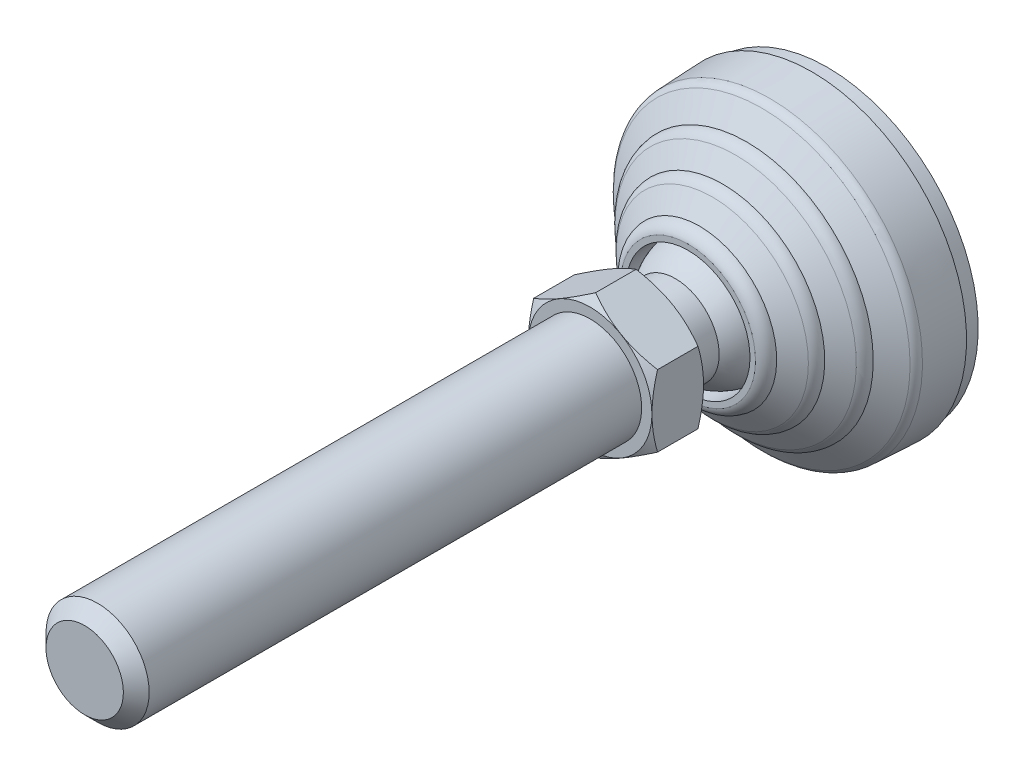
ISO-10303-21;
HEADER;
FILE_DESCRIPTION(('STEP AP214'),'2;1');
FILE_NAME('part.step','',(''),(''),'','','');
FILE_SCHEMA(('AUTOMOTIVE_DESIGN { 1 0 10303 214 1 1 1 1 }'));
ENDSEC;
DATA;
#1=APPLICATION_CONTEXT('core data for automotive mechanical design processes');
#2=APPLICATION_PROTOCOL_DEFINITION('international standard','automotive_design',2000,#1);
#3=PRODUCT_CONTEXT('',#1,'mechanical');
#4=PRODUCT('Part','Part','',(#3));
#5=PRODUCT_RELATED_PRODUCT_CATEGORY('part','',(#4));
#6=PRODUCT_DEFINITION_FORMATION('','',#4);
#7=PRODUCT_DEFINITION_CONTEXT('part definition',#1,'design');
#8=PRODUCT_DEFINITION('design','',#6,#7);
#9=PRODUCT_DEFINITION_SHAPE('','',#8);
#10=(LENGTH_UNIT() NAMED_UNIT(*) SI_UNIT(.MILLI.,.METRE.));
#11=(NAMED_UNIT(*) PLANE_ANGLE_UNIT() SI_UNIT($,.RADIAN.));
#12=(NAMED_UNIT(*) SI_UNIT($,.STERADIAN.) SOLID_ANGLE_UNIT());
#13=UNCERTAINTY_MEASURE_WITH_UNIT(LENGTH_MEASURE(1.E-05),#10,'distance_accuracy_value','');
#14=(GEOMETRIC_REPRESENTATION_CONTEXT(3) GLOBAL_UNCERTAINTY_ASSIGNED_CONTEXT((#13)) GLOBAL_UNIT_ASSIGNED_CONTEXT((#10,
#11,#12)) REPRESENTATION_CONTEXT('',''));
#15=CARTESIAN_POINT('',(0.,0.,0.));
#16=DIRECTION('',(0.,0.,1.));
#17=DIRECTION('',(1.,0.,0.));
#18=AXIS2_PLACEMENT_3D('',#15,#16,#17);
#19=CARTESIAN_POINT('',(0.,0.,93.4665));
#20=DIRECTION('',(0.,0.,-1.));
#21=DIRECTION('',(0.,1.,0.));
#22=AXIS2_PLACEMENT_3D('',#19,#20,#21);
#23=CYLINDRICAL_SURFACE('',#22,10.);
#24=CARTESIAN_POINT('',(0.,0.,141.5));
#25=DIRECTION('',(0.,0.,1.));
#26=DIRECTION('',(0.,-1.,0.));
#27=AXIS2_PLACEMENT_3D('',#24,#25,#26);
#28=CIRCLE('',#27,10.);
#29=CARTESIAN_POINT('',(0.,-10.,141.5));
#30=VERTEX_POINT('',#29);
#31=EDGE_CURVE('E9',#30,#30,#28,.F.);
#32=ORIENTED_EDGE('',*,*,#31,.T.);
#33=EDGE_LOOP('',(#32));
#34=FACE_BOUND('',#33,.T.);
#35=CARTESIAN_POINT('',(0.,0.,46.));
#36=DIRECTION('',(0.,0.,-1.));
#37=DIRECTION('',(0.,1.,0.));
#38=AXIS2_PLACEMENT_3D('',#35,#36,#37);
#39=CIRCLE('',#38,10.);
#40=CARTESIAN_POINT('',(0.,10.,46.));
#41=VERTEX_POINT('',#40);
#42=EDGE_CURVE('E124',#41,#41,#39,.F.);
#43=ORIENTED_EDGE('',*,*,#42,.T.);
#44=EDGE_LOOP('',(#43));
#45=FACE_BOUND('',#44,.T.);
#46=ADVANCED_FACE('F14',(#34,#45),#23,.T.);
#47=CARTESIAN_POINT('',(10.995,0.,46.));
#48=DIRECTION('',(0.,0.,1.));
#49=DIRECTION('',(0.,-1.,0.));
#50=AXIS2_PLACEMENT_3D('',#47,#48,#49);
#51=PLANE('',#50);
#52=CARTESIAN_POINT('',(0.,0.,46.));
#53=DIRECTION('',(0.,0.,-1.));
#54=DIRECTION('',(0.,1.,0.));
#55=AXIS2_PLACEMENT_3D('',#52,#53,#54);
#56=CIRCLE('',#55,11.99);
#57=CARTESIAN_POINT('',(0.,11.99,46.));
#58=VERTEX_POINT('',#57);
#59=EDGE_CURVE('E132',#58,#58,#56,.F.);
#60=ORIENTED_EDGE('',*,*,#59,.T.);
#61=EDGE_LOOP('',(#60));
#62=FACE_BOUND('',#61,.T.);
#63=ORIENTED_EDGE('',*,*,#42,.F.);
#64=EDGE_LOOP('',(#63));
#65=FACE_BOUND('',#64,.T.);
#66=ADVANCED_FACE('F157',(#62,#65),#51,.T.);
#67=CARTESIAN_POINT('',(0.,0.,44.9159643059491));
#68=DIRECTION('',(0.,0.,-1.));
#69=DIRECTION('',(0.,1.,0.));
#70=AXIS2_PLACEMENT_3D('',#67,#68,#69);
#71=CONICAL_SURFACE('',#70,13.8676048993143,1.0471975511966);
#72=ORIENTED_EDGE('',*,*,#59,.F.);
#73=EDGE_LOOP('',(#72));
#74=FACE_BOUND('',#73,.T.);
#75=CARTESIAN_POINT('',(-2.88482840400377E-08,-13.8564064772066,44.9224297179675));
#76=CARTESIAN_POINT('',(0.263784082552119,-13.7041106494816,45.010340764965));
#77=CARTESIAN_POINT('',(0.528551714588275,-13.5512469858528,45.0942615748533));
#78=CARTESIAN_POINT('',(1.06021019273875,-13.2442938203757,45.2530155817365));
#79=CARTESIAN_POINT('',(1.32710170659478,-13.0902039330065,45.3278457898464));
#80=CARTESIAN_POINT('',(2.13207647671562,-12.6254515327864,45.537252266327));
#81=CARTESIAN_POINT('',(2.67333741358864,-12.3129543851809,45.6563603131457));
#82=CARTESIAN_POINT('',(3.48330954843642,-11.8453167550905,45.796023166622));
#83=CARTESIAN_POINT('',(3.74960108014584,-11.6915732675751,45.8358073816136));
#84=CARTESIAN_POINT('',(4.28341699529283,-11.3833745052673,45.9025217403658));
#85=CARTESIAN_POINT('',(4.55094140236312,-11.2289192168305,45.9294516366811));
#86=CARTESIAN_POINT('',(5.08643614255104,-10.9197511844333,45.9697675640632));
#87=CARTESIAN_POINT('',(5.35440556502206,-10.7650389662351,45.9831696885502));
#88=CARTESIAN_POINT('',(5.8905925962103,-10.4554712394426,45.996144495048));
#89=CARTESIAN_POINT('',(6.15881019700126,-10.3006157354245,45.9957176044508));
#90=CARTESIAN_POINT('',(6.66023029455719,-10.0111207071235,45.9820002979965));
#91=CARTESIAN_POINT('',(6.89346857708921,-9.87646052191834,45.97038309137));
#92=CARTESIAN_POINT('',(7.35940867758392,-9.60744987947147,45.9369099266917));
#93=CARTESIAN_POINT('',(7.59211045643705,-9.47309944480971,45.9150532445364));
#94=CARTESIAN_POINT('',(8.05685109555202,-9.20478131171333,45.8614821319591));
#95=CARTESIAN_POINT('',(8.28888924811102,-9.07081402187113,45.8297595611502));
#96=CARTESIAN_POINT('',(8.75187776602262,-8.80350747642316,45.7570131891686));
#97=CARTESIAN_POINT('',(8.98282805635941,-8.67016826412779,45.7159887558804));
#98=CARTESIAN_POINT('',(9.68388987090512,-8.26541003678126,45.5779256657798));
#99=CARTESIAN_POINT('',(10.1519713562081,-7.99516306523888,45.4671213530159));
#100=CARTESIAN_POINT('',(11.081155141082,-7.45869855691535,45.2156417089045));
#101=CARTESIAN_POINT('',(11.5422693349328,-7.19247415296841,45.075025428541));
#102=CARTESIAN_POINT('',(11.9999999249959,-6.92820327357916,44.922429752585));
#103=B_SPLINE_CURVE_WITH_KNOTS('',3,(#75,#76,#77,#78,#79,#80,#81,#82,#83,#84,#85,#86,#87,#88,
#89,#90,#91,#92,#93,#94,#95,#96,#97,#98,#99,#100,#101,#102),.UNSPECIFIED.,.F.,.F.,(4,2,2,2,2,2,
2,2,2,2,2,2,2,4),(0.,0.950996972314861,1.90230578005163,3.80897261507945,4.73890631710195,
5.6688579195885,6.59770188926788,7.52651715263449,8.33503482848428,9.14360968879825,
9.95285348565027,10.7621522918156,12.4163368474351,14.0672749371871),.UNSPECIFIED.);
#104=CARTESIAN_POINT('',(-1.44241383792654E-08,-13.8564064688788,44.9224297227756));
#105=VERTEX_POINT('',#104);
#106=CARTESIAN_POINT('',(12.,-6.92820324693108,44.9224297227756));
#107=VERTEX_POINT('',#106);
#108=EDGE_CURVE('E143',#105,#107,#103,.T.);
#109=ORIENTED_EDGE('',*,*,#108,.T.);
#110=CARTESIAN_POINT('',(12.,-6.92820326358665,44.9224297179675));
#111=CARTESIAN_POINT('',(12.,-6.64374493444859,45.0045333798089));
#112=CARTESIAN_POINT('',(12.,-6.35829458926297,45.0831531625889));
#113=CARTESIAN_POINT('',(12.,-5.78524260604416,45.2325348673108));
#114=CARTESIAN_POINT('',(12.,-5.49764024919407,45.3032940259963));
#115=CARTESIAN_POINT('',(12.,-4.63053083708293,45.5026195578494));
#116=CARTESIAN_POINT('',(12.,-4.04782834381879,45.6179071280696));
#117=CARTESIAN_POINT('',(12.,-3.17548925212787,45.7575170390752));
#118=CARTESIAN_POINT('',(12.,-2.88840964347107,45.7982045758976));
#119=CARTESIAN_POINT('',(12.,-2.31290718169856,45.8685767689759));
#120=CARTESIAN_POINT('',(12.,-2.02448443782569,45.8982623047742));
#121=CARTESIAN_POINT('',(12.,-1.44696804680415,45.9459902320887));
#122=CARTESIAN_POINT('',(12.,-1.15787537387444,45.9640443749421));
#123=CARTESIAN_POINT('',(12.,-0.579188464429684,45.9881624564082));
#124=CARTESIAN_POINT('',(12.,-0.289594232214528,45.994226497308));
#125=CARTESIAN_POINT('',(12.,0.289594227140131,45.9942264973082));
#126=CARTESIAN_POINT('',(12.,0.579188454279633,45.9881624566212));
#127=CARTESIAN_POINT('',(12.,1.15787535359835,45.9640443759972));
#128=CARTESIAN_POINT('',(12.,1.44696802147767,45.9459902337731));
#129=CARTESIAN_POINT('',(12.,2.02448440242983,45.8982623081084));
#130=CARTESIAN_POINT('',(12.,2.31290714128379,45.8685767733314));
#131=CARTESIAN_POINT('',(12.,2.88840959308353,45.798204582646));
#132=CARTESIAN_POINT('',(12.,3.17548919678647,45.7575170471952));
#133=CARTESIAN_POINT('',(12.,4.04782827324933,45.6179071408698));
#134=CARTESIAN_POINT('',(12.,4.63053075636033,45.5026195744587));
#135=CARTESIAN_POINT('',(12.,5.49764015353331,45.3032940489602));
#136=CARTESIAN_POINT('',(12.,5.78524250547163,45.2325348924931));
#137=CARTESIAN_POINT('',(12.,6.35829447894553,45.0831531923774));
#138=CARTESIAN_POINT('',(12.,6.64374481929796,45.004533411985));
#139=CARTESIAN_POINT('',(12.,6.92820314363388,44.9224297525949));
#140=B_SPLINE_CURVE_WITH_KNOTS('',3,(#110,#111,#112,#113,#114,#115,#116,#117,#118,#119,#120,
#121,#122,#123,#124,#125,#126,#127,#128,#129,#130,#131,#132,#133,#134,#135,#136,#137,#138,#139),
.UNSPECIFIED.,.F.,.F.,(4,2,2,2,2,2,2,2,2,2,2,2,2,2,4),(0.,0.888148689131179,1.77660860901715,
3.55698615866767,4.42666281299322,5.2962699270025,6.16499708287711,7.03371682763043,
7.90243655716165,8.7711636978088,9.64077079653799,10.5104474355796,12.2908249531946,
13.1792848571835,14.0674335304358),.UNSPECIFIED.);
#141=CARTESIAN_POINT('',(12.0000000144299,6.92820322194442,44.9224297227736));
#142=VERTEX_POINT('',#141);
#143=EDGE_CURVE('E135',#107,#142,#140,.T.);
#144=ORIENTED_EDGE('',*,*,#143,.T.);
#145=CARTESIAN_POINT('',(12.0000000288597,6.92820321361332,44.9224297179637));
#146=CARTESIAN_POINT('',(11.7362159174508,7.08049904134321,45.0103407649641));
#147=CARTESIAN_POINT('',(11.4714482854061,7.23336270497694,45.0942615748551));
#148=CARTESIAN_POINT('',(10.9397898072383,7.54031587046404,45.2530155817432));
#149=CARTESIAN_POINT('',(10.6728982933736,7.69440575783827,45.3278457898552));
#150=CARTESIAN_POINT('',(9.86792352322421,8.15915815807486,45.5372522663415));
#151=CARTESIAN_POINT('',(9.32666258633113,8.47165530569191,45.6563603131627));
#152=CARTESIAN_POINT('',(8.51669045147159,8.93929293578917,45.7960231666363));
#153=CARTESIAN_POINT('',(8.25039891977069,9.0930364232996,45.8358073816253));
#154=CARTESIAN_POINT('',(7.71658300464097,9.40123518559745,45.9025217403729));
#155=CARTESIAN_POINT('',(7.44905859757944,9.55569047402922,45.9294516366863));
#156=CARTESIAN_POINT('',(6.91356385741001,9.86485850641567,45.9697675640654));
#157=CARTESIAN_POINT('',(6.64559443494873,10.0195707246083,45.9831696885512));
#158=CARTESIAN_POINT('',(6.10940740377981,10.3291384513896,45.996144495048));
#159=CARTESIAN_POINT('',(5.84118980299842,10.4839939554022,45.9957176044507));
#160=CARTESIAN_POINT('',(5.33976970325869,10.773488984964,45.9820002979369));
#161=CARTESIAN_POINT('',(5.10653141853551,10.9081491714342,45.970383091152));
#162=CARTESIAN_POINT('',(4.64059131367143,11.1771598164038,45.9369099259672));
#163=CARTESIAN_POINT('',(4.4078895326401,11.3115102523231,45.9150532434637));
#164=CARTESIAN_POINT('',(3.94314888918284,11.5798283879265,45.8614821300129));
#165=CARTESIAN_POINT('',(3.71111073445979,11.7137956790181,45.8297595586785));
#166=CARTESIAN_POINT('',(3.24812221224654,11.9811022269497,45.7570131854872));
#167=CARTESIAN_POINT('',(3.01717191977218,12.1144414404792,45.7159887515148));
#168=CARTESIAN_POINT('',(2.31611009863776,12.5191996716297,45.5779256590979));
#169=CARTESIAN_POINT('',(1.84802860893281,12.7894466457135,45.4671213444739));
#170=CARTESIAN_POINT('',(0.918844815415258,13.3259111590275,45.2156416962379));
#171=CARTESIAN_POINT('',(0.457730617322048,13.5921355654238,45.0750254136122));
#172=CARTESIAN_POINT('',(2.30778996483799E-08,13.856406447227,44.9224297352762));
#173=B_SPLINE_CURVE_WITH_KNOTS('',3,(#145,#146,#147,#148,#149,#150,#151,#152,#153,#154,#155,
#156,#157,#158,#159,#160,#161,#162,#163,#164,#165,#166,#167,#168,#169,#170,#171,#172),
.UNSPECIFIED.,.F.,.F.,(4,2,2,2,2,2,2,2,2,2,2,2,2,4),(0.,0.95099697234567,1.9023057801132,
3.8089726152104,4.73890631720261,5.66885791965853,6.59770188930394,7.52651715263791,
8.33503483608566,9.14360970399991,9.95285350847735,10.7621523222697,12.4163368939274,
14.0672749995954),.UNSPECIFIED.);
#174=CARTESIAN_POINT('',(-1.15389591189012E-08,13.856406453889,44.92242973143));
#175=VERTEX_POINT('',#174);
#176=EDGE_CURVE('E181',#142,#175,#173,.T.);
#177=ORIENTED_EDGE('',*,*,#176,.T.);
#178=CARTESIAN_POINT('',(-2.30779115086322E-08,13.856406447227,44.9224297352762));
#179=CARTESIAN_POINT('',(-0.263784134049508,13.7041106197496,45.0103407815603));
#180=CARTESIAN_POINT('',(-0.528551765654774,13.5512469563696,45.0942615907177));
#181=CARTESIAN_POINT('',(-1.06021024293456,13.2442937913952,45.2530155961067));
#182=CARTESIAN_POINT('',(-1.32710175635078,13.0902039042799,45.3278458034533));
#183=CARTESIAN_POINT('',(-2.13207652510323,12.6254515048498,45.5372522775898));
#184=CARTESIAN_POINT('',(-2.67333746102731,12.3129543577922,45.656360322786));
#185=CARTESIAN_POINT('',(-3.48330959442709,11.8453167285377,45.7960231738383));
#186=CARTESIAN_POINT('',(-3.74960112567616,11.6915732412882,45.8358073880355));
#187=CARTESIAN_POINT('',(-4.28341703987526,11.3833744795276,45.9025217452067));
#188=CARTESIAN_POINT('',(-4.55094144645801,11.2289191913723,45.9294516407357));
#189=CARTESIAN_POINT('',(-5.08643618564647,10.9197511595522,45.9697675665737));
#190=CARTESIAN_POINT('',(-5.35440560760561,10.7650389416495,45.9831696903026));
#191=CARTESIAN_POINT('',(-5.89059263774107,10.4554712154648,45.9961444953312));
#192=CARTESIAN_POINT('',(-6.15881023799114,10.300615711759,45.9957176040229));
#193=CARTESIAN_POINT('',(-6.66023033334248,10.0111206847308,45.9820002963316));
#194=CARTESIAN_POINT('',(-6.89346861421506,9.87646050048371,45.9703830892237));
#195=CARTESIAN_POINT('',(-7.35940871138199,9.60744985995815,45.9369099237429));
#196=CARTESIAN_POINT('',(-7.59211048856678,9.47309942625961,45.9150532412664));
#197=CARTESIAN_POINT('',(-8.05685112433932,9.20478129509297,45.8614821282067));
#198=CARTESIAN_POINT('',(-8.28888927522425,9.0708140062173,45.8297595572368));
#199=CARTESIAN_POINT('',(-8.75187778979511,8.80350746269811,45.7570131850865));
#200=CARTESIAN_POINT('',(-8.98282807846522,8.67016825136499,45.7159887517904));
#201=CARTESIAN_POINT('',(-9.68388988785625,8.26541002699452,45.5779256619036));
#202=CARTESIAN_POINT('',(-10.1519713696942,7.9951630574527,45.4671213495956));
#203=CARTESIAN_POINT('',(-11.0811551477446,7.45869855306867,45.2156417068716));
#204=CARTESIAN_POINT('',(-11.5422693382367,7.19247415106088,45.0750254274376));
#205=CARTESIAN_POINT('',(-11.9999999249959,6.92820327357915,44.922429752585));
#206=B_SPLINE_CURVE_WITH_KNOTS('',3,(#178,#179,#180,#181,#182,#183,#184,#185,#186,#187,#188,
#189,#190,#191,#192,#193,#194,#195,#196,#197,#198,#199,#200,#201,#202,#203,#204,#205),
.UNSPECIFIED.,.F.,.F.,(4,2,2,2,2,2,2,2,2,2,2,2,2,4),(0.,0.9509969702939,1.90230577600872,
3.80897260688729,4.73890630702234,5.6688579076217,6.5977018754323,7.52651713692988,
8.33503480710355,9.14360966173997,9.95285345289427,10.7621522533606,12.4163367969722,
14.0672748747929),.UNSPECIFIED.);
#207=CARTESIAN_POINT('',(-12.,6.92820324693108,44.9224297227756));
#208=VERTEX_POINT('',#207);
#209=EDGE_CURVE('E173',#175,#208,#206,.T.);
#210=ORIENTED_EDGE('',*,*,#209,.T.);
#211=CARTESIAN_POINT('',(-12.,6.92820326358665,44.9224297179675));
#212=CARTESIAN_POINT('',(-12.,6.64374493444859,45.0045333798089));
#213=CARTESIAN_POINT('',(-12.,6.35829458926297,45.0831531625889));
#214=CARTESIAN_POINT('',(-12.,5.78524260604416,45.2325348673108));
#215=CARTESIAN_POINT('',(-12.,5.49764024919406,45.3032940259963));
#216=CARTESIAN_POINT('',(-12.,4.63053083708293,45.5026195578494));
#217=CARTESIAN_POINT('',(-12.,4.04782834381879,45.6179071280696));
#218=CARTESIAN_POINT('',(-12.,3.17548925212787,45.7575170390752));
#219=CARTESIAN_POINT('',(-12.,2.88840964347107,45.7982045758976));
#220=CARTESIAN_POINT('',(-12.,2.31290718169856,45.8685767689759));
#221=CARTESIAN_POINT('',(-12.,2.02448443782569,45.8982623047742));
#222=CARTESIAN_POINT('',(-12.,1.44696804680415,45.9459902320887));
#223=CARTESIAN_POINT('',(-12.,1.15787537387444,45.9640443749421));
#224=CARTESIAN_POINT('',(-12.,0.579188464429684,45.9881624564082));
#225=CARTESIAN_POINT('',(-12.,0.289594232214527,45.994226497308));
#226=CARTESIAN_POINT('',(-12.,-0.289594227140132,45.9942264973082));
#227=CARTESIAN_POINT('',(-12.,-0.579188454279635,45.9881624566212));
#228=CARTESIAN_POINT('',(-12.,-1.15787535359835,45.9640443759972));
#229=CARTESIAN_POINT('',(-12.,-1.44696802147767,45.9459902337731));
#230=CARTESIAN_POINT('',(-12.,-2.02448440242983,45.8982623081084));
#231=CARTESIAN_POINT('',(-12.,-2.31290714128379,45.8685767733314));
#232=CARTESIAN_POINT('',(-12.,-2.88840959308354,45.798204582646));
#233=CARTESIAN_POINT('',(-12.,-3.17548919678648,45.7575170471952));
#234=CARTESIAN_POINT('',(-12.,-4.04782827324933,45.6179071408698));
#235=CARTESIAN_POINT('',(-12.,-4.63053075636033,45.5026195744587));
#236=CARTESIAN_POINT('',(-12.,-5.49764015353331,45.3032940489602));
#237=CARTESIAN_POINT('',(-12.,-5.78524250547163,45.2325348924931));
#238=CARTESIAN_POINT('',(-12.,-6.35829447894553,45.0831531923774));
#239=CARTESIAN_POINT('',(-12.,-6.64374481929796,45.004533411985));
#240=CARTESIAN_POINT('',(-12.,-6.92820314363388,44.9224297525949));
#241=B_SPLINE_CURVE_WITH_KNOTS('',3,(#211,#212,#213,#214,#215,#216,#217,#218,#219,#220,#221,
#222,#223,#224,#225,#226,#227,#228,#229,#230,#231,#232,#233,#234,#235,#236,#237,#238,#239,#240),
.UNSPECIFIED.,.F.,.F.,(4,2,2,2,2,2,2,2,2,2,2,2,2,2,4),(0.,0.888148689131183,1.77660860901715,
3.55698615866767,4.42666281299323,5.2962699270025,6.16499708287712,7.03371682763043,
7.90243655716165,8.7711636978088,9.640770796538,10.5104474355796,12.2908249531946,
13.1792848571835,14.0674335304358),.UNSPECIFIED.);
#242=CARTESIAN_POINT('',(-12.0000000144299,-6.92820322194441,44.9224297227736));
#243=VERTEX_POINT('',#242);
#244=EDGE_CURVE('E350',#208,#243,#241,.T.);
#245=ORIENTED_EDGE('',*,*,#244,.T.);
#246=CARTESIAN_POINT('',(-12.0000000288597,-6.92820321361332,44.9224297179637));
#247=CARTESIAN_POINT('',(-11.7362159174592,-7.08049904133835,45.0103407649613));
#248=CARTESIAN_POINT('',(-11.471448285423,-7.23336270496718,45.0942615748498));
#249=CARTESIAN_POINT('',(-10.9397898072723,-7.54031587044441,45.2530155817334));
#250=CARTESIAN_POINT('',(-10.6728982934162,-7.69440575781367,45.3278457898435));
#251=CARTESIAN_POINT('',(-9.86792352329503,-8.15915815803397,45.5372522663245));
#252=CARTESIAN_POINT('',(-9.3266625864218,-8.47165530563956,45.6563603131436));
#253=CARTESIAN_POINT('',(-8.5166904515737,-8.93929293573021,45.7960231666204));
#254=CARTESIAN_POINT('',(-8.25039891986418,-9.09303642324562,45.8358073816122));
#255=CARTESIAN_POINT('',(-7.71658300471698,-9.40123518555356,45.9025217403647));
#256=CARTESIAN_POINT('',(-7.44905859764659,-9.55569047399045,45.9294516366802));
#257=CARTESIAN_POINT('',(-6.91356385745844,-9.8648585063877,45.9697675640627));
#258=CARTESIAN_POINT('',(-6.64559443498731,-10.019570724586,45.9831696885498));
#259=CARTESIAN_POINT('',(-6.10940740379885,-10.3291384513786,45.996144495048));
#260=CARTESIAN_POINT('',(-5.84118980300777,-10.4839939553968,45.9957176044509));
#261=CARTESIAN_POINT('',(-5.33976970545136,-10.7734889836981,45.9820002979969));
#262=CARTESIAN_POINT('',(-5.10653142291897,-10.9081491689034,45.9703830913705));
#263=CARTESIAN_POINT('',(-4.64059132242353,-11.1771598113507,45.9369099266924));
#264=CARTESIAN_POINT('',(-4.40788954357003,-11.3115102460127,45.9150532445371));
#265=CARTESIAN_POINT('',(-3.94314890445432,-11.5798283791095,45.8614821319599));
#266=CARTESIAN_POINT('',(-3.71111075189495,-11.7137956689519,45.8297595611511));
#267=CARTESIAN_POINT('',(-3.24812223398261,-11.9811022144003,45.7570131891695));
#268=CARTESIAN_POINT('',(-3.01717194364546,-12.1144414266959,45.7159887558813));
#269=CARTESIAN_POINT('',(-2.3161101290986,-12.5191996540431,45.5779256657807));
#270=CARTESIAN_POINT('',(-1.84802864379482,-12.7894466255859,45.4671213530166));
#271=CARTESIAN_POINT('',(-0.918844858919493,-13.3259111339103,45.215641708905));
#272=CARTESIAN_POINT('',(-0.457730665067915,-13.5921355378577,45.0750254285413));
#273=CARTESIAN_POINT('',(-7.50040961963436E-08,-13.8564064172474,44.922429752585));
#274=B_SPLINE_CURVE_WITH_KNOTS('',3,(#246,#247,#248,#249,#250,#251,#252,#253,#254,#255,#256,
#257,#258,#259,#260,#261,#262,#263,#264,#265,#266,#267,#268,#269,#270,#271,#272,#273),
.UNSPECIFIED.,.F.,.F.,(4,2,2,2,2,2,2,2,2,2,2,2,2,4),(0.,0.950996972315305,1.90230578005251,
3.80897261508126,4.73890631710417,5.66885791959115,6.59770188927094,7.52651715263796,
8.33503482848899,9.14360968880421,9.95285348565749,10.7621522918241,12.4163368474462,
14.0672749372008),.UNSPECIFIED.);
#275=EDGE_CURVE('E163',#243,#105,#274,.T.);
#276=ORIENTED_EDGE('',*,*,#275,.T.);
#277=EDGE_LOOP('',(#109,#144,#177,#210,#245,#276));
#278=FACE_BOUND('',#277,.T.);
#279=ADVANCED_FACE('F152',(#74,#278),#71,.T.);
#280=CARTESIAN_POINT('',(0.,-13.856406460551,46.1));
#281=DIRECTION('',(0.5,0.866025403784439,0.));
#282=DIRECTION('',(-0.866025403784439,0.5,0.));
#283=AXIS2_PLACEMENT_3D('',#280,#281,#282);
#284=PLANE('',#283);
#285=DIRECTION('',(0.,0.,1.));
#286=VECTOR('',#285,1.);
#287=CARTESIAN_POINT('',(0.,-13.856406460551,46.1));
#288=LINE('',#287,#286);
#289=CARTESIAN_POINT('',(0.,-13.856406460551,37.0775702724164));
#290=VERTEX_POINT('',#289);
#291=EDGE_CURVE('E376',#290,#105,#288,.T.);
#292=ORIENTED_EDGE('',*,*,#291,.T.);
#293=ORIENTED_EDGE('',*,*,#275,.F.);
#294=DIRECTION('',(0.,0.,1.));
#295=VECTOR('',#294,1.);
#296=CARTESIAN_POINT('',(-12.,-6.9282032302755,46.1));
#297=LINE('',#296,#295);
#298=CARTESIAN_POINT('',(-12.,-6.9282032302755,37.0775702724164));
#299=VERTEX_POINT('',#298);
#300=EDGE_CURVE('E368',#299,#243,#297,.T.);
#301=ORIENTED_EDGE('',*,*,#300,.F.);
#302=CARTESIAN_POINT('',(0.,-13.856406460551,37.0775702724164));
#303=CARTESIAN_POINT('',(-0.263784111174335,-13.7041106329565,36.9896592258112));
#304=CARTESIAN_POINT('',(-0.528551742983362,-13.5512469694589,36.9057384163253));
#305=CARTESIAN_POINT('',(-1.0602102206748,-13.2442938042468,36.7469844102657));
#306=CARTESIAN_POINT('',(-1.32710173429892,-13.0902039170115,36.6721542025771));
#307=CARTESIAN_POINT('',(-2.13207650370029,-12.6254515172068,36.4627477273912));
#308=CARTESIAN_POINT('',(-2.67333744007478,-12.3129543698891,36.3436396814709));
#309=CARTESIAN_POINT('',(-3.48330957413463,-11.8453167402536,36.2039768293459));
#310=CARTESIAN_POINT('',(-3.74960110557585,-11.6915732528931,36.1641926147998));
#311=CARTESIAN_POINT('',(-4.28341702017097,-11.3833744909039,36.097478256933));
#312=CARTESIAN_POINT('',(-4.55094142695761,-11.2289192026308,36.0705483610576));
#313=CARTESIAN_POINT('',(-5.08643616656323,-10.9197511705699,36.0302324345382));
#314=CARTESIAN_POINT('',(-5.35440558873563,-10.765038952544,36.0168303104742));
#315=CARTESIAN_POINT('',(-5.89059261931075,-10.4554712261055,36.0038555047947));
#316=CARTESIAN_POINT('',(-6.15881021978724,-10.300615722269,36.0042823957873));
#317=CARTESIAN_POINT('',(-6.66023031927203,-10.0111206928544,36.0179997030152));
#318=CARTESIAN_POINT('',(-6.8934686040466,-9.87646050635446,36.029616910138));
#319=CARTESIAN_POINT('',(-7.35940870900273,-9.6074498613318,36.063090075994));
#320=CARTESIAN_POINT('',(-7.59211049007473,-9.47309942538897,36.0849467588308));
#321=CARTESIAN_POINT('',(-8.05685113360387,-9.20478128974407,36.1385178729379));
#322=CARTESIAN_POINT('',(-8.28888928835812,-9.07081399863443,36.1702404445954));
#323=CARTESIAN_POINT('',(-8.75187781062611,-8.8035074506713,36.2429868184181));
#324=CARTESIAN_POINT('',(-8.98282810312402,-8.67016823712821,36.2840112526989));
#325=CARTESIAN_POINT('',(-9.6838899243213,-8.2654100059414,36.4220743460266));
#326=CARTESIAN_POINT('',(-10.1519714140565,-7.99516303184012,36.5328786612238));
#327=CARTESIAN_POINT('',(-11.0811552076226,-7.45869851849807,36.7843583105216));
#328=CARTESIAN_POINT('',(-11.5422694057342,-7.19247411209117,36.924974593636));
#329=CARTESIAN_POINT('',(-12.,-6.9282032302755,37.0775702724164));
#330=B_SPLINE_CURVE_WITH_KNOTS('',3,(#302,#303,#304,#305,#306,#307,#308,#309,#310,#311,#312,
#313,#314,#315,#316,#317,#318,#319,#320,#321,#322,#323,#324,#325,#326,#327,#328,#329),
.UNSPECIFIED.,.F.,.F.,(4,2,2,2,2,2,2,2,2,2,2,2,2,4),(0.,0.950996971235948,1.90230577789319,
3.80897261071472,4.73890631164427,5.66885791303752,6.59770188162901,7.52651714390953,
8.33503482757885,9.14360969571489,9.9528535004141,10.7621523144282,12.4163368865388,
14.0672749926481),.UNSPECIFIED.);
#331=EDGE_CURVE('E370',#290,#299,#330,.T.);
#332=ORIENTED_EDGE('',*,*,#331,.F.);
#333=EDGE_LOOP('',(#292,#293,#301,#332));
#334=FACE_BOUND('',#333,.T.);
#335=ADVANCED_FACE('F156',(#334),#284,.F.);
#336=CARTESIAN_POINT('',(12.,-6.92820323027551,46.1));
#337=DIRECTION('',(-0.5,0.866025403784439,0.));
#338=DIRECTION('',(-0.866025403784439,-0.5,0.));
#339=AXIS2_PLACEMENT_3D('',#336,#337,#338);
#340=PLANE('',#339);
#341=DIRECTION('',(0.,0.,1.));
#342=VECTOR('',#341,1.);
#343=CARTESIAN_POINT('',(12.,-6.92820323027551,46.1));
#344=LINE('',#343,#342);
#345=CARTESIAN_POINT('',(12.,-6.92820323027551,37.0775702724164));
#346=VERTEX_POINT('',#345);
#347=EDGE_CURVE('E31',#346,#107,#344,.T.);
#348=ORIENTED_EDGE('',*,*,#347,.T.);
#349=ORIENTED_EDGE('',*,*,#108,.F.);
#350=ORIENTED_EDGE('',*,*,#291,.F.);
#351=CARTESIAN_POINT('',(12.,-6.92820323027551,37.0775702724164));
#352=CARTESIAN_POINT('',(11.7362158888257,-7.08049905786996,36.9896592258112));
#353=CARTESIAN_POINT('',(11.4714482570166,-7.2333627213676,36.9057384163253));
#354=CARTESIAN_POINT('',(10.9397897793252,-7.5403158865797,36.7469844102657));
#355=CARTESIAN_POINT('',(10.6728982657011,-7.69440577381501,36.6721542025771));
#356=CARTESIAN_POINT('',(9.86792349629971,-8.15915817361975,36.4627477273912));
#357=CARTESIAN_POINT('',(9.32666255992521,-8.4716553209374,36.3436396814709));
#358=CARTESIAN_POINT('',(8.51669042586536,-8.93929295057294,36.2039768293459));
#359=CARTESIAN_POINT('',(8.25039889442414,-9.09303643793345,36.1641926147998));
#360=CARTESIAN_POINT('',(7.71658297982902,-9.40123519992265,36.097478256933));
#361=CARTESIAN_POINT('',(7.44905857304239,-9.55569048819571,36.0705483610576));
#362=CARTESIAN_POINT('',(6.91356383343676,-9.86485852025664,36.0302324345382));
#363=CARTESIAN_POINT('',(6.64559441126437,-10.0195707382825,36.0168303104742));
#364=CARTESIAN_POINT('',(6.10940738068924,-10.329138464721,36.0038555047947));
#365=CARTESIAN_POINT('',(5.84118978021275,-10.4839939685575,36.0042823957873));
#366=CARTESIAN_POINT('',(5.33976968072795,-10.7734889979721,36.0179997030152));
#367=CARTESIAN_POINT('',(5.10653139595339,-10.9081491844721,36.029616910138));
#368=CARTESIAN_POINT('',(4.64059129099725,-11.1771598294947,36.063090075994));
#369=CARTESIAN_POINT('',(4.40788950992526,-11.3115102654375,36.0849467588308));
#370=CARTESIAN_POINT('',(3.94314886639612,-11.5798284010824,36.1385178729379));
#371=CARTESIAN_POINT('',(3.71111071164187,-11.7137956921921,36.1702404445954));
#372=CARTESIAN_POINT('',(3.24812218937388,-11.9811022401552,36.2429868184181));
#373=CARTESIAN_POINT('',(3.01717189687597,-12.1144414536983,36.2840112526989));
#374=CARTESIAN_POINT('',(2.3161100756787,-12.5191996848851,36.4220743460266));
#375=CARTESIAN_POINT('',(1.84802858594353,-12.7894466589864,36.5328786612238));
#376=CARTESIAN_POINT('',(0.918844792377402,-13.3259111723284,36.7843583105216));
#377=CARTESIAN_POINT('',(0.457730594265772,-13.5921355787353,36.924974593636));
#378=CARTESIAN_POINT('',(0.,-13.856406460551,37.0775702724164));
#379=B_SPLINE_CURVE_WITH_KNOTS('',3,(#351,#352,#353,#354,#355,#356,#357,#358,#359,#360,#361,
#362,#363,#364,#365,#366,#367,#368,#369,#370,#371,#372,#373,#374,#375,#376,#377,#378),
.UNSPECIFIED.,.F.,.F.,(4,2,2,2,2,2,2,2,2,2,2,2,2,4),(0.,0.95099697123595,1.90230577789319,
3.80897261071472,4.73890631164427,5.66885791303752,6.59770188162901,7.52651714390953,
8.33503482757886,9.14360969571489,9.9528535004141,10.7621523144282,12.4163368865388,
14.0672749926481),.UNSPECIFIED.);
#380=EDGE_CURVE('E377',#346,#290,#379,.T.);
#381=ORIENTED_EDGE('',*,*,#380,.F.);
#382=EDGE_LOOP('',(#348,#349,#350,#381));
#383=FACE_BOUND('',#382,.T.);
#384=ADVANCED_FACE('F383',(#383),#340,.F.);
#385=CARTESIAN_POINT('',(-12.,6.92820323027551,46.1));
#386=DIRECTION('',(0.5,-0.866025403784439,0.));
#387=DIRECTION('',(0.866025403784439,0.5,0.));
#388=AXIS2_PLACEMENT_3D('',#385,#386,#387);
#389=PLANE('',#388);
#390=DIRECTION('',(0.,0.,1.));
#391=VECTOR('',#390,1.);
#392=CARTESIAN_POINT('',(-12.,6.92820323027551,46.1));
#393=LINE('',#392,#391);
#394=CARTESIAN_POINT('',(-12.,6.92820323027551,37.0775702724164));
#395=VERTEX_POINT('',#394);
#396=EDGE_CURVE('E369',#395,#208,#393,.T.);
#397=ORIENTED_EDGE('',*,*,#396,.T.);
#398=ORIENTED_EDGE('',*,*,#209,.F.);
#399=DIRECTION('',(0.,0.,1.));
#400=VECTOR('',#399,1.);
#401=CARTESIAN_POINT('',(0.,13.856406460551,46.1));
#402=LINE('',#401,#400);
#403=CARTESIAN_POINT('',(0.,13.856406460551,37.0775702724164));
#404=VERTEX_POINT('',#403);
#405=EDGE_CURVE('E212',#404,#175,#402,.T.);
#406=ORIENTED_EDGE('',*,*,#405,.F.);
#407=CARTESIAN_POINT('',(-12.,6.92820323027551,37.0775702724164));
#408=CARTESIAN_POINT('',(-11.7362158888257,7.08049905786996,36.9896592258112));
#409=CARTESIAN_POINT('',(-11.4714482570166,7.2333627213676,36.9057384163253));
#410=CARTESIAN_POINT('',(-10.9397897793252,7.5403158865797,36.7469844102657));
#411=CARTESIAN_POINT('',(-10.6728982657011,7.69440577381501,36.6721542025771));
#412=CARTESIAN_POINT('',(-9.86792349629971,8.15915817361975,36.4627477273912));
#413=CARTESIAN_POINT('',(-9.32666255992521,8.4716553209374,36.3436396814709));
#414=CARTESIAN_POINT('',(-8.51669042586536,8.93929295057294,36.2039768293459));
#415=CARTESIAN_POINT('',(-8.25039889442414,9.09303643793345,36.1641926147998));
#416=CARTESIAN_POINT('',(-7.71658297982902,9.40123519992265,36.097478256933));
#417=CARTESIAN_POINT('',(-7.44905857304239,9.55569048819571,36.0705483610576));
#418=CARTESIAN_POINT('',(-6.91356383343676,9.86485852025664,36.0302324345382));
#419=CARTESIAN_POINT('',(-6.64559441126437,10.0195707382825,36.0168303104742));
#420=CARTESIAN_POINT('',(-6.10940738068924,10.329138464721,36.0038555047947));
#421=CARTESIAN_POINT('',(-5.84118978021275,10.4839939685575,36.0042823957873));
#422=CARTESIAN_POINT('',(-5.33976968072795,10.7734889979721,36.0179997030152));
#423=CARTESIAN_POINT('',(-5.10653139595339,10.9081491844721,36.029616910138));
#424=CARTESIAN_POINT('',(-4.64059129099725,11.1771598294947,36.063090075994));
#425=CARTESIAN_POINT('',(-4.40788950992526,11.3115102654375,36.0849467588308));
#426=CARTESIAN_POINT('',(-3.94314886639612,11.5798284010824,36.1385178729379));
#427=CARTESIAN_POINT('',(-3.71111071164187,11.7137956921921,36.1702404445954));
#428=CARTESIAN_POINT('',(-3.24812218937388,11.9811022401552,36.2429868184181));
#429=CARTESIAN_POINT('',(-3.01717189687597,12.1144414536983,36.2840112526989));
#430=CARTESIAN_POINT('',(-2.3161100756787,12.5191996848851,36.4220743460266));
#431=CARTESIAN_POINT('',(-1.84802858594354,12.7894466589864,36.5328786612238));
#432=CARTESIAN_POINT('',(-0.918844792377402,13.3259111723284,36.7843583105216));
#433=CARTESIAN_POINT('',(-0.457730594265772,13.5921355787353,36.924974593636));
#434=CARTESIAN_POINT('',(0.,13.856406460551,37.0775702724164));
#435=B_SPLINE_CURVE_WITH_KNOTS('',3,(#407,#408,#409,#410,#411,#412,#413,#414,#415,#416,#417,
#418,#419,#420,#421,#422,#423,#424,#425,#426,#427,#428,#429,#430,#431,#432,#433,#434),
.UNSPECIFIED.,.F.,.F.,(4,2,2,2,2,2,2,2,2,2,2,2,2,4),(0.,0.95099697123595,1.90230577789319,
3.80897261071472,4.73890631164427,5.66885791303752,6.59770188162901,7.52651714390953,
8.33503482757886,9.14360969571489,9.9528535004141,10.7621523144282,12.4163368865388,
14.0672749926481),.UNSPECIFIED.);
#436=EDGE_CURVE('E214',#395,#404,#435,.T.);
#437=ORIENTED_EDGE('',*,*,#436,.F.);
#438=EDGE_LOOP('',(#397,#398,#406,#437));
#439=FACE_BOUND('',#438,.T.);
#440=ADVANCED_FACE('F200',(#439),#389,.F.);
#441=CARTESIAN_POINT('',(-12.,-6.92820323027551,46.1));
#442=DIRECTION('',(1.,0.,0.));
#443=DIRECTION('',(0.,1.,0.));
#444=AXIS2_PLACEMENT_3D('',#441,#442,#443);
#445=PLANE('',#444);
#446=ORIENTED_EDGE('',*,*,#300,.T.);
#447=ORIENTED_EDGE('',*,*,#244,.F.);
#448=ORIENTED_EDGE('',*,*,#396,.F.);
#449=CARTESIAN_POINT('',(-12.,-6.9282032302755,37.0775702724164));
#450=CARTESIAN_POINT('',(-12.,-6.64374490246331,36.9954666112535));
#451=CARTESIAN_POINT('',(-12.,-6.35829455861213,36.9168468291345));
#452=CARTESIAN_POINT('',(-12.,-5.78524257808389,36.7674651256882));
#453=CARTESIAN_POINT('',(-12.,-5.49764022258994,36.6967059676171));
#454=CARTESIAN_POINT('',(-12.,-4.63053081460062,36.4973804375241));
#455=CARTESIAN_POINT('',(-12.,-4.04782832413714,36.3820928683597));
#456=CARTESIAN_POINT('',(-12.,-3.17548923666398,36.2424829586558));
#457=CARTESIAN_POINT('',(-12.,-2.88840962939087,36.2017954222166));
#458=CARTESIAN_POINT('',(-12.,-2.31290717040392,36.1314232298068));
#459=CARTESIAN_POINT('',(-12.,-2.02448442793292,36.1017376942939));
#460=CARTESIAN_POINT('',(-12.,-1.44696803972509,36.0540097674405));
#461=CARTESIAN_POINT('',(-12.,-1.1578753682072,36.035955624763));
#462=CARTESIAN_POINT('',(-12.,-0.579188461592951,36.0118375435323));
#463=CARTESIAN_POINT('',(-12.,-0.289594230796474,36.0057735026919));
#464=CARTESIAN_POINT('',(-12.,0.28959423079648,36.0057735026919));
#465=CARTESIAN_POINT('',(-12.,0.579188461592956,36.0118375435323));
#466=CARTESIAN_POINT('',(-12.,1.15787536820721,36.035955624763));
#467=CARTESIAN_POINT('',(-12.,1.4469680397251,36.0540097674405));
#468=CARTESIAN_POINT('',(-12.,2.02448442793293,36.1017376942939));
#469=CARTESIAN_POINT('',(-12.,2.31290717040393,36.1314232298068));
#470=CARTESIAN_POINT('',(-12.,2.88840962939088,36.2017954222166));
#471=CARTESIAN_POINT('',(-12.,3.17548923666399,36.2424829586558));
#472=CARTESIAN_POINT('',(-12.,4.04782832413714,36.3820928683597));
#473=CARTESIAN_POINT('',(-12.,4.63053081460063,36.4973804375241));
#474=CARTESIAN_POINT('',(-12.,5.49764022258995,36.6967059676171));
#475=CARTESIAN_POINT('',(-12.,5.7852425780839,36.7674651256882));
#476=CARTESIAN_POINT('',(-12.,6.35829455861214,36.9168468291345));
#477=CARTESIAN_POINT('',(-12.,6.64374490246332,36.9954666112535));
#478=CARTESIAN_POINT('',(-12.,6.92820323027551,37.0775702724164));
#479=B_SPLINE_CURVE_WITH_KNOTS('',3,(#449,#450,#451,#452,#453,#454,#455,#456,#457,#458,#459,
#460,#461,#462,#463,#464,#465,#466,#467,#468,#469,#470,#471,#472,#473,#474,#475,#476,#477,#478),
.UNSPECIFIED.,.F.,.F.,(4,2,2,2,2,2,2,2,2,2,2,2,2,2,4),(0.,0.888148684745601,1.77660860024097,
3.55698614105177,4.42666279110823,5.29626990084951,6.16499705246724,7.03371679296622,
7.90243653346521,8.77116368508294,9.64077079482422,10.5104474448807,12.2908249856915,
13.1792849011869,14.0674335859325),.UNSPECIFIED.);
#480=EDGE_CURVE('E362',#299,#395,#479,.T.);
#481=ORIENTED_EDGE('',*,*,#480,.F.);
#482=EDGE_LOOP('',(#446,#447,#448,#481));
#483=FACE_BOUND('',#482,.T.);
#484=ADVANCED_FACE('F356',(#483),#445,.F.);
#485=CARTESIAN_POINT('',(12.,6.92820323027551,46.1));
#486=DIRECTION('',(-1.,0.,0.));
#487=DIRECTION('',(0.,-1.,0.));
#488=AXIS2_PLACEMENT_3D('',#485,#486,#487);
#489=PLANE('',#488);
#490=DIRECTION('',(0.,0.,1.));
#491=VECTOR('',#490,1.);
#492=CARTESIAN_POINT('',(12.,6.92820323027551,46.1));
#493=LINE('',#492,#491);
#494=CARTESIAN_POINT('',(12.,6.9282032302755,37.0775702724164));
#495=VERTEX_POINT('',#494);
#496=EDGE_CURVE('E410',#142,#495,#493,.F.);
#497=ORIENTED_EDGE('',*,*,#496,.F.);
#498=ORIENTED_EDGE('',*,*,#143,.F.);
#499=ORIENTED_EDGE('',*,*,#347,.F.);
#500=CARTESIAN_POINT('',(12.,6.92820323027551,37.0775702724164));
#501=CARTESIAN_POINT('',(12.,6.64374490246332,36.9954666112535));
#502=CARTESIAN_POINT('',(12.,6.35829455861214,36.9168468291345));
#503=CARTESIAN_POINT('',(12.,5.7852425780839,36.7674651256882));
#504=CARTESIAN_POINT('',(12.,5.49764022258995,36.6967059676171));
#505=CARTESIAN_POINT('',(12.,4.63053081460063,36.4973804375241));
#506=CARTESIAN_POINT('',(12.,4.04782832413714,36.3820928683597));
#507=CARTESIAN_POINT('',(12.,3.17548923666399,36.2424829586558));
#508=CARTESIAN_POINT('',(12.,2.88840962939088,36.2017954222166));
#509=CARTESIAN_POINT('',(12.,2.31290717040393,36.1314232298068));
#510=CARTESIAN_POINT('',(12.,2.02448442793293,36.1017376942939));
#511=CARTESIAN_POINT('',(12.,1.4469680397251,36.0540097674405));
#512=CARTESIAN_POINT('',(12.,1.1578753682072,36.035955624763));
#513=CARTESIAN_POINT('',(12.,0.579188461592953,36.0118375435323));
#514=CARTESIAN_POINT('',(12.,0.289594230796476,36.0057735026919));
#515=CARTESIAN_POINT('',(12.,-0.289594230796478,36.0057735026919));
#516=CARTESIAN_POINT('',(12.,-0.579188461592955,36.0118375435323));
#517=CARTESIAN_POINT('',(12.,-1.15787536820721,36.035955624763));
#518=CARTESIAN_POINT('',(12.,-1.4469680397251,36.0540097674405));
#519=CARTESIAN_POINT('',(12.,-2.02448442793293,36.1017376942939));
#520=CARTESIAN_POINT('',(12.,-2.31290717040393,36.1314232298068));
#521=CARTESIAN_POINT('',(12.,-2.88840962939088,36.2017954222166));
#522=CARTESIAN_POINT('',(12.,-3.17548923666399,36.2424829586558));
#523=CARTESIAN_POINT('',(12.,-4.04782832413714,36.3820928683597));
#524=CARTESIAN_POINT('',(12.,-4.63053081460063,36.4973804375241));
#525=CARTESIAN_POINT('',(12.,-5.49764022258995,36.6967059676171));
#526=CARTESIAN_POINT('',(12.,-5.7852425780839,36.7674651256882));
#527=CARTESIAN_POINT('',(12.,-6.35829455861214,36.9168468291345));
#528=CARTESIAN_POINT('',(12.,-6.64374490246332,36.9954666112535));
#529=CARTESIAN_POINT('',(12.,-6.92820323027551,37.0775702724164));
#530=B_SPLINE_CURVE_WITH_KNOTS('',3,(#500,#501,#502,#503,#504,#505,#506,#507,#508,#509,#510,
#511,#512,#513,#514,#515,#516,#517,#518,#519,#520,#521,#522,#523,#524,#525,#526,#527,#528,#529),
.UNSPECIFIED.,.F.,.F.,(4,2,2,2,2,2,2,2,2,2,2,2,2,2,4),(0.,0.888148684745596,1.77660860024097,
3.55698614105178,4.42666279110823,5.29626990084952,6.16499705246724,7.03371679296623,
7.90243653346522,8.77116368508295,9.64077079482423,10.5104474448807,12.2908249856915,
13.1792849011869,14.0674335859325),.UNSPECIFIED.);
#531=EDGE_CURVE('E189',#495,#346,#530,.T.);
#532=ORIENTED_EDGE('',*,*,#531,.F.);
#533=EDGE_LOOP('',(#497,#498,#499,#532));
#534=FACE_BOUND('',#533,.T.);
#535=ADVANCED_FACE('F150',(#534),#489,.F.);
#536=CARTESIAN_POINT('',(0.,13.856406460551,46.1));
#537=DIRECTION('',(-0.5,-0.866025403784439,0.));
#538=DIRECTION('',(0.866025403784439,-0.5,0.));
#539=AXIS2_PLACEMENT_3D('',#536,#537,#538);
#540=PLANE('',#539);
#541=ORIENTED_EDGE('',*,*,#405,.T.);
#542=ORIENTED_EDGE('',*,*,#176,.F.);
#543=ORIENTED_EDGE('',*,*,#496,.T.);
#544=CARTESIAN_POINT('',(0.,13.856406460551,37.0775702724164));
#545=CARTESIAN_POINT('',(0.263784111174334,13.7041106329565,36.9896592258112));
#546=CARTESIAN_POINT('',(0.528551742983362,13.5512469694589,36.9057384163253));
#547=CARTESIAN_POINT('',(1.0602102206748,13.2442938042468,36.7469844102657));
#548=CARTESIAN_POINT('',(1.32710173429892,13.0902039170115,36.6721542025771));
#549=CARTESIAN_POINT('',(2.13207650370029,12.6254515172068,36.4627477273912));
#550=CARTESIAN_POINT('',(2.67333744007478,12.3129543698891,36.3436396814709));
#551=CARTESIAN_POINT('',(3.48330957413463,11.8453167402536,36.2039768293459));
#552=CARTESIAN_POINT('',(3.74960110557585,11.6915732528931,36.1641926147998));
#553=CARTESIAN_POINT('',(4.28341702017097,11.3833744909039,36.097478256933));
#554=CARTESIAN_POINT('',(4.55094142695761,11.2289192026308,36.0705483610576));
#555=CARTESIAN_POINT('',(5.08643616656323,10.9197511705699,36.0302324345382));
#556=CARTESIAN_POINT('',(5.35440558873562,10.765038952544,36.0168303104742));
#557=CARTESIAN_POINT('',(5.89059261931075,10.4554712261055,36.0038555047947));
#558=CARTESIAN_POINT('',(6.15881021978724,10.300615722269,36.0042823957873));
#559=CARTESIAN_POINT('',(6.66023031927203,10.0111206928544,36.0179997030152));
#560=CARTESIAN_POINT('',(6.8934686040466,9.87646050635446,36.029616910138));
#561=CARTESIAN_POINT('',(7.35940870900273,9.6074498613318,36.063090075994));
#562=CARTESIAN_POINT('',(7.59211049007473,9.47309942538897,36.0849467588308));
#563=CARTESIAN_POINT('',(8.05685113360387,9.20478128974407,36.1385178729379));
#564=CARTESIAN_POINT('',(8.28888928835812,9.07081399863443,36.1702404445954));
#565=CARTESIAN_POINT('',(8.75187781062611,8.8035074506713,36.2429868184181));
#566=CARTESIAN_POINT('',(8.98282810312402,8.67016823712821,36.2840112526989));
#567=CARTESIAN_POINT('',(9.6838899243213,8.2654100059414,36.4220743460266));
#568=CARTESIAN_POINT('',(10.1519714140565,7.99516303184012,36.5328786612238));
#569=CARTESIAN_POINT('',(11.0811552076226,7.45869851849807,36.7843583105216));
#570=CARTESIAN_POINT('',(11.5422694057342,7.19247411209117,36.924974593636));
#571=CARTESIAN_POINT('',(12.,6.9282032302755,37.0775702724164));
#572=B_SPLINE_CURVE_WITH_KNOTS('',3,(#544,#545,#546,#547,#548,#549,#550,#551,#552,#553,#554,
#555,#556,#557,#558,#559,#560,#561,#562,#563,#564,#565,#566,#567,#568,#569,#570,#571),
.UNSPECIFIED.,.F.,.F.,(4,2,2,2,2,2,2,2,2,2,2,2,2,4),(0.,0.950996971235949,1.90230577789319,
3.80897261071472,4.73890631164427,5.66885791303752,6.59770188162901,7.52651714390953,
8.33503482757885,9.14360969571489,9.9528535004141,10.7621523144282,12.4163368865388,
14.0672749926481),.UNSPECIFIED.);
#573=EDGE_CURVE('E68',#404,#495,#572,.T.);
#574=ORIENTED_EDGE('',*,*,#573,.F.);
#575=EDGE_LOOP('',(#541,#542,#543,#574));
#576=FACE_BOUND('',#575,.T.);
#577=ADVANCED_FACE('F196',(#576),#540,.F.);
#578=CARTESIAN_POINT('',(0.,0.,37.0840356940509));
#579=DIRECTION('',(0.,0.,1.));
#580=DIRECTION('',(0.,-1.,0.));
#581=AXIS2_PLACEMENT_3D('',#578,#579,#580);
#582=CONICAL_SURFACE('',#581,13.8676048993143,1.0471975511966);
#583=CARTESIAN_POINT('',(0.,0.,36.));
#584=DIRECTION('',(0.,0.,1.));
#585=DIRECTION('',(0.,-1.,0.));
#586=AXIS2_PLACEMENT_3D('',#583,#584,#585);
#587=CIRCLE('',#586,11.99);
#588=CARTESIAN_POINT('',(0.,-11.99,36.));
#589=VERTEX_POINT('',#588);
#590=EDGE_CURVE('E213',#589,#589,#587,.T.);
#591=ORIENTED_EDGE('',*,*,#590,.T.);
#592=EDGE_LOOP('',(#591));
#593=FACE_BOUND('',#592,.T.);
#594=ORIENTED_EDGE('',*,*,#573,.T.);
#595=ORIENTED_EDGE('',*,*,#531,.T.);
#596=ORIENTED_EDGE('',*,*,#380,.T.);
#597=ORIENTED_EDGE('',*,*,#331,.T.);
#598=ORIENTED_EDGE('',*,*,#480,.T.);
#599=ORIENTED_EDGE('',*,*,#436,.T.);
#600=EDGE_LOOP('',(#594,#595,#596,#597,#598,#599));
#601=FACE_BOUND('',#600,.T.);
#602=ADVANCED_FACE('F199',(#593,#601),#582,.T.);
#603=CARTESIAN_POINT('',(10.245,0.,36.));
#604=DIRECTION('',(0.,0.,-1.));
#605=DIRECTION('',(0.,1.,0.));
#606=AXIS2_PLACEMENT_3D('',#603,#604,#605);
#607=PLANE('',#606);
#608=CARTESIAN_POINT('',(0.,0.,36.));
#609=DIRECTION('',(0.,0.,-1.));
#610=DIRECTION('',(0.,1.,0.));
#611=AXIS2_PLACEMENT_3D('',#608,#609,#610);
#612=CIRCLE('',#611,8.5);
#613=CARTESIAN_POINT('',(0.,8.5,36.));
#614=VERTEX_POINT('',#613);
#615=EDGE_CURVE('E222',#614,#614,#612,.F.);
#616=ORIENTED_EDGE('',*,*,#615,.T.);
#617=EDGE_LOOP('',(#616));
#618=FACE_BOUND('',#617,.T.);
#619=ORIENTED_EDGE('',*,*,#590,.F.);
#620=EDGE_LOOP('',(#619));
#621=FACE_BOUND('',#620,.T.);
#622=ADVANCED_FACE('F437',(#618,#621),#607,.T.);
#623=CARTESIAN_POINT('',(0.,0.,32.7352685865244));
#624=DIRECTION('',(0.,0.,-1.));
#625=DIRECTION('',(0.,1.,0.));
#626=AXIS2_PLACEMENT_3D('',#623,#624,#625);
#627=CYLINDRICAL_SURFACE('',#626,8.5);
#628=ORIENTED_EDGE('',*,*,#615,.F.);
#629=EDGE_LOOP('',(#628));
#630=FACE_BOUND('',#629,.T.);
#631=CARTESIAN_POINT('',(0.,0.,29.4705371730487));
#632=DIRECTION('',(0.,0.,-1.));
#633=DIRECTION('',(0.,1.,0.));
#634=AXIS2_PLACEMENT_3D('',#631,#632,#633);
#635=CIRCLE('',#634,8.5);
#636=CARTESIAN_POINT('',(0.,8.5,29.4705371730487));
#637=VERTEX_POINT('',#636);
#638=EDGE_CURVE('E97',#637,#637,#635,.F.);
#639=ORIENTED_EDGE('',*,*,#638,.T.);
#640=EDGE_LOOP('',(#639));
#641=FACE_BOUND('',#640,.T.);
#642=ADVANCED_FACE('F117',(#630,#641),#627,.T.);
#643=CARTESIAN_POINT('',(0.,0.,21.));
#644=DIRECTION('',(1.,0.,0.));
#645=DIRECTION('',(0.,0.,1.));
#646=AXIS2_PLACEMENT_3D('',#643,#644,#645);
#647=SPHERICAL_SURFACE('',#646,12.);
#648=CARTESIAN_POINT('',(0.,0.,21.));
#649=DIRECTION('',(0.,0.,1.));
#650=DIRECTION('',(1.,0.,0.));
#651=AXIS2_PLACEMENT_3D('',#648,#649,#650);
#652=CIRCLE('',#651,12.);
#653=CARTESIAN_POINT('',(0.,12.,21.));
#654=VERTEX_POINT('',#653);
#655=CARTESIAN_POINT('',(-12.,0.,21.));
#656=VERTEX_POINT('',#655);
#657=EDGE_CURVE('E77',#654,#656,#652,.T.);
#658=ORIENTED_EDGE('',*,*,#657,.T.);
#659=CARTESIAN_POINT('',(-12.,0.,21.));
#660=CARTESIAN_POINT('',(-12.0000041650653,-0.196349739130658,21.));
#661=CARTESIAN_POINT('',(-11.9951810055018,-0.392699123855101,21.));
#662=CARTESIAN_POINT('',(-11.9759099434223,-0.784925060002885,21.));
#663=CARTESIAN_POINT('',(-11.9614620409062,-0.980801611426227,21.));
#664=CARTESIAN_POINT('',(-11.9229713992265,-1.37160975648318,21.));
#665=CARTESIAN_POINT('',(-11.8989286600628,-1.5665413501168,21.));
#666=CARTESIAN_POINT('',(-11.841307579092,-1.95499003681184,21.));
#667=CARTESIAN_POINT('',(-11.8077292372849,-2.14850712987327,21.));
#668=CARTESIAN_POINT('',(-11.7311174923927,-2.53366059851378,21.));
#669=CARTESIAN_POINT('',(-11.6880840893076,-2.72529697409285,21.));
#670=CARTESIAN_POINT('',(-11.5926659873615,-3.10622734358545,21.));
#671=CARTESIAN_POINT('',(-11.5402812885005,-3.29552133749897,21.));
#672=CARTESIAN_POINT('',(-11.4262867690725,-3.67131091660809,21.));
#673=CARTESIAN_POINT('',(-11.3646769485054,-3.85780650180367,21.));
#674=CARTESIAN_POINT('',(-11.2323806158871,-4.22754997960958,21.));
#675=CARTESIAN_POINT('',(-11.1616941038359,-4.41079787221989,21.));
#676=CARTESIAN_POINT('',(-11.011414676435,-4.77360450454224,21.));
#677=CARTESIAN_POINT('',(-10.9318217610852,-4.95316324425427,21.));
#678=CARTESIAN_POINT('',(-10.7639212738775,-5.30815899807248,21.));
#679=CARTESIAN_POINT('',(-10.6756137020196,-5.48359601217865,21.));
#680=CARTESIAN_POINT('',(-10.4904966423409,-5.82992567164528,21.));
#681=CARTESIAN_POINT('',(-10.3936871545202,-6.00081831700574,21.));
#682=CARTESIAN_POINT('',(-10.1917994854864,-6.33764754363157,21.));
#683=CARTESIAN_POINT('',(-10.0867213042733,-6.50358412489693,20.9999999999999));
#684=CARTESIAN_POINT('',(-9.8685493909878,-6.83010146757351,20.9999999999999));
#685=CARTESIAN_POINT('',(-9.75545565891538,-6.99068222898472,20.9999999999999));
#686=CARTESIAN_POINT('',(-9.5215250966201,-7.30610107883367,20.9999999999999));
#687=CARTESIAN_POINT('',(-9.40068826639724,-7.4609391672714,20.9999999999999));
#688=CARTESIAN_POINT('',(-9.15156261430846,-7.76449965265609,20.9999999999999));
#689=CARTESIAN_POINT('',(-9.02327379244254,-7.91322204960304,20.9999999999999));
#690=CARTESIAN_POINT('',(-8.75955321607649,-8.20419286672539,20.9999999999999));
#691=CARTESIAN_POINT('',(-8.62412146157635,-8.3464412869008,20.9999999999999));
#692=CARTESIAN_POINT('',(-8.3464412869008,-8.62412146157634,20.9999999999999));
#693=CARTESIAN_POINT('',(-8.2041928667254,-8.75955321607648,20.9999999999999));
#694=CARTESIAN_POINT('',(-7.91322204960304,-9.02327379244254,20.9999999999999));
#695=CARTESIAN_POINT('',(-7.76449965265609,-9.15156261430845,20.9999999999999));
#696=CARTESIAN_POINT('',(-7.4609391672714,-9.40068826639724,20.9999999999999));
#697=CARTESIAN_POINT('',(-7.30610107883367,-9.5215250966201,20.9999999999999));
#698=CARTESIAN_POINT('',(-6.99068222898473,-9.75545565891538,20.9999999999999));
#699=CARTESIAN_POINT('',(-6.83010146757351,-9.8685493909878,20.9999999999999));
#700=CARTESIAN_POINT('',(-6.50358412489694,-10.0867213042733,20.9999999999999));
#701=CARTESIAN_POINT('',(-6.33764754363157,-10.1917994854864,20.9999999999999));
#702=CARTESIAN_POINT('',(-6.00081831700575,-10.3936871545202,20.9999999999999));
#703=CARTESIAN_POINT('',(-5.82992567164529,-10.4904966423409,20.9999999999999));
#704=CARTESIAN_POINT('',(-5.48359601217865,-10.6756137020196,20.9999999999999));
#705=CARTESIAN_POINT('',(-5.30815899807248,-10.7639212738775,20.9999999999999));
#706=CARTESIAN_POINT('',(-4.95316324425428,-10.9318217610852,20.9999999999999));
#707=CARTESIAN_POINT('',(-4.77360450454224,-11.011414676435,20.9999999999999));
#708=CARTESIAN_POINT('',(-4.4107978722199,-11.1616941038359,20.9999999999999));
#709=CARTESIAN_POINT('',(-4.22754997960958,-11.2323806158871,20.9999999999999));
#710=CARTESIAN_POINT('',(-3.85780650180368,-11.3646769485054,20.9999999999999));
#711=CARTESIAN_POINT('',(-3.6713109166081,-11.4262867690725,20.9999999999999));
#712=CARTESIAN_POINT('',(-3.29552133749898,-11.5402812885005,20.9999999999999));
#713=CARTESIAN_POINT('',(-3.10622734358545,-11.5926659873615,20.9999999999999));
#714=CARTESIAN_POINT('',(-2.72529697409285,-11.6880840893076,20.9999999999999));
#715=CARTESIAN_POINT('',(-2.53366059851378,-11.7311174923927,20.9999999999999));
#716=CARTESIAN_POINT('',(-2.14850712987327,-11.8077292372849,20.9999999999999));
#717=CARTESIAN_POINT('',(-1.95499003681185,-11.841307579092,20.9999999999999));
#718=CARTESIAN_POINT('',(-1.5665413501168,-11.8989286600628,20.9999999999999));
#719=CARTESIAN_POINT('',(-1.37160975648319,-11.9229713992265,20.9999999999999));
#720=CARTESIAN_POINT('',(-0.980801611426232,-11.9614620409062,20.9999999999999));
#721=CARTESIAN_POINT('',(-0.78492506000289,-11.9759099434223,20.9999999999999));
#722=CARTESIAN_POINT('',(-0.392699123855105,-11.9951810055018,20.9999999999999));
#723=CARTESIAN_POINT('',(-0.196349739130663,-12.0000041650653,20.9999999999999));
#724=CARTESIAN_POINT('',(0.,-12.,20.9999999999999));
#725=B_SPLINE_CURVE_WITH_KNOTS('',3,(#659,#660,#661,#662,#663,#664,#665,#666,#667,#668,#669,
#670,#671,#672,#673,#674,#675,#676,#677,#678,#679,#680,#681,#682,#683,#684,#685,#686,#687,#688,
#689,#690,#691,#692,#693,#694,#695,#696,#697,#698,#699,#700,#701,#702,#703,#704,#705,#706,#707,
#708,#709,#710,#711,#712,#713,#714,#715,#716,#717,#718,#719,#720,#721,#722,#723,#724),
.UNSPECIFIED.,.F.,.F.,(4,2,2,2,2,2,2,2,2,2,2,2,2,2,2,2,2,2,2,2,2,2,2,2,2,2,2,2,2,2,2,2,4),(0.,
0.588989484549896,1.17797896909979,1.76696845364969,2.35595793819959,2.94494742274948,
3.53393690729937,4.12292639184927,4.71191587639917,5.30090536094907,5.88989484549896,
6.47888433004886,7.06787381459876,7.65686329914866,8.24585278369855,8.83484226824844,
9.42383175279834,10.0128212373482,10.6018107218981,11.190800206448,11.7797896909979,
12.3687791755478,12.9577686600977,13.5467581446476,14.1357476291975,14.7247371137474,
15.3137265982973,15.9027160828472,16.4917055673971,17.080695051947,17.6696845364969,
18.2586740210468,18.8476635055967),.UNSPECIFIED.);
#726=CARTESIAN_POINT('',(0.,-12.,21.));
#727=VERTEX_POINT('',#726);
#728=EDGE_CURVE('E88',#656,#727,#725,.T.);
#729=ORIENTED_EDGE('',*,*,#728,.T.);
#730=CARTESIAN_POINT('',(0.,0.,21.));
#731=DIRECTION('',(0.,0.,-1.));
#732=DIRECTION('',(1.,0.,0.));
#733=AXIS2_PLACEMENT_3D('',#730,#731,#732);
#734=CIRCLE('',#733,12.);
#735=CARTESIAN_POINT('',(12.,0.,21.));
#736=VERTEX_POINT('',#735);
#737=EDGE_CURVE('E83',#727,#736,#734,.F.);
#738=ORIENTED_EDGE('',*,*,#737,.T.);
#739=CARTESIAN_POINT('',(12.,0.,21.));
#740=CARTESIAN_POINT('',(12.0000041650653,0.196349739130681,21.));
#741=CARTESIAN_POINT('',(11.9951810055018,0.392699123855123,21.));
#742=CARTESIAN_POINT('',(11.9759099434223,0.784925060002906,21.));
#743=CARTESIAN_POINT('',(11.9614620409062,0.980801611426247,21.));
#744=CARTESIAN_POINT('',(11.9229713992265,1.3716097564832,21.));
#745=CARTESIAN_POINT('',(11.8989286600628,1.56654135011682,21.));
#746=CARTESIAN_POINT('',(11.841307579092,1.95499003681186,21.));
#747=CARTESIAN_POINT('',(11.8077292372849,2.14850712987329,21.));
#748=CARTESIAN_POINT('',(11.7311174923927,2.53366059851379,21.));
#749=CARTESIAN_POINT('',(11.6880840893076,2.72529697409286,21.));
#750=CARTESIAN_POINT('',(11.5926659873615,3.10622734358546,21.));
#751=CARTESIAN_POINT('',(11.5402812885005,3.29552133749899,21.));
#752=CARTESIAN_POINT('',(11.4262867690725,3.6713109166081,21.));
#753=CARTESIAN_POINT('',(11.3646769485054,3.85780650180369,21.));
#754=CARTESIAN_POINT('',(11.2323806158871,4.22754997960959,21.));
#755=CARTESIAN_POINT('',(11.1616941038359,4.4107978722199,21.));
#756=CARTESIAN_POINT('',(11.011414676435,4.77360450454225,21.));
#757=CARTESIAN_POINT('',(10.9318217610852,4.95316324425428,21.));
#758=CARTESIAN_POINT('',(10.7639212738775,5.30815899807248,21.));
#759=CARTESIAN_POINT('',(10.6756137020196,5.48359601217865,21.));
#760=CARTESIAN_POINT('',(10.4904966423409,5.82992567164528,21.));
#761=CARTESIAN_POINT('',(10.3936871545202,6.00081831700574,21.));
#762=CARTESIAN_POINT('',(10.1917994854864,6.33764754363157,21.));
#763=CARTESIAN_POINT('',(10.0867213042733,6.50358412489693,21.));
#764=CARTESIAN_POINT('',(9.8685493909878,6.83010146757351,21.));
#765=CARTESIAN_POINT('',(9.75545565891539,6.99068222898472,21.));
#766=CARTESIAN_POINT('',(9.5215250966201,7.30610107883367,21.));
#767=CARTESIAN_POINT('',(9.40068826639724,7.4609391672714,21.));
#768=CARTESIAN_POINT('',(9.15156261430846,7.76449965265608,21.));
#769=CARTESIAN_POINT('',(9.02327379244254,7.91322204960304,21.));
#770=CARTESIAN_POINT('',(8.75955321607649,8.20419286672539,21.));
#771=CARTESIAN_POINT('',(8.62412146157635,8.3464412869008,21.));
#772=CARTESIAN_POINT('',(8.34644128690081,8.62412146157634,21.));
#773=CARTESIAN_POINT('',(8.20419286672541,8.75955321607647,21.));
#774=CARTESIAN_POINT('',(7.91322204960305,9.02327379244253,21.));
#775=CARTESIAN_POINT('',(7.7644996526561,9.15156261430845,21.));
#776=CARTESIAN_POINT('',(7.46093916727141,9.40068826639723,21.));
#777=CARTESIAN_POINT('',(7.30610107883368,9.52152509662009,21.));
#778=CARTESIAN_POINT('',(6.99068222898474,9.75545565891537,21.));
#779=CARTESIAN_POINT('',(6.83010146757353,9.86854939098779,21.));
#780=CARTESIAN_POINT('',(6.50358412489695,10.0867213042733,21.));
#781=CARTESIAN_POINT('',(6.33764754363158,10.1917994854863,21.));
#782=CARTESIAN_POINT('',(6.00081831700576,10.3936871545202,21.));
#783=CARTESIAN_POINT('',(5.8299256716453,10.4904966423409,21.));
#784=CARTESIAN_POINT('',(5.48359601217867,10.6756137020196,21.));
#785=CARTESIAN_POINT('',(5.3081589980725,10.7639212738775,21.));
#786=CARTESIAN_POINT('',(4.9531632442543,10.9318217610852,21.));
#787=CARTESIAN_POINT('',(4.77360450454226,11.011414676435,21.));
#788=CARTESIAN_POINT('',(4.41079787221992,11.1616941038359,21.));
#789=CARTESIAN_POINT('',(4.2275499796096,11.2323806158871,21.));
#790=CARTESIAN_POINT('',(3.8578065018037,11.3646769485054,21.));
#791=CARTESIAN_POINT('',(3.67131091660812,11.4262867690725,21.));
#792=CARTESIAN_POINT('',(3.29552133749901,11.5402812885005,21.));
#793=CARTESIAN_POINT('',(3.10622734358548,11.5926659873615,21.));
#794=CARTESIAN_POINT('',(2.72529697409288,11.6880840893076,21.));
#795=CARTESIAN_POINT('',(2.53366059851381,11.7311174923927,21.));
#796=CARTESIAN_POINT('',(2.1485071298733,11.8077292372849,21.));
#797=CARTESIAN_POINT('',(1.95499003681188,11.841307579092,21.));
#798=CARTESIAN_POINT('',(1.56654135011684,11.8989286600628,21.));
#799=CARTESIAN_POINT('',(1.37160975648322,11.9229713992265,21.));
#800=CARTESIAN_POINT('',(0.980801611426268,11.9614620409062,21.));
#801=CARTESIAN_POINT('',(0.784925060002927,11.9759099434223,21.));
#802=CARTESIAN_POINT('',(0.392699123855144,11.9951810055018,21.));
#803=CARTESIAN_POINT('',(0.196349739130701,12.0000041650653,21.));
#804=CARTESIAN_POINT('',(0.,12.,21.));
#805=B_SPLINE_CURVE_WITH_KNOTS('',3,(#739,#740,#741,#742,#743,#744,#745,#746,#747,#748,#749,
#750,#751,#752,#753,#754,#755,#756,#757,#758,#759,#760,#761,#762,#763,#764,#765,#766,#767,#768,
#769,#770,#771,#772,#773,#774,#775,#776,#777,#778,#779,#780,#781,#782,#783,#784,#785,#786,#787,
#788,#789,#790,#791,#792,#793,#794,#795,#796,#797,#798,#799,#800,#801,#802,#803,#804),
.UNSPECIFIED.,.F.,.F.,(4,2,2,2,2,2,2,2,2,2,2,2,2,2,2,2,2,2,2,2,2,2,2,2,2,2,2,2,2,2,2,2,4),(0.,
0.588989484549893,1.17797896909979,1.76696845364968,2.35595793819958,2.94494742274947,
3.53393690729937,4.12292639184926,4.71191587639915,5.30090536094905,5.88989484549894,
6.47888433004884,7.06787381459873,7.65686329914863,8.24585278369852,8.83484226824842,
9.42383175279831,10.0128212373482,10.6018107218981,11.190800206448,11.7797896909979,
12.3687791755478,12.9577686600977,13.5467581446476,14.1357476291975,14.7247371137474,
15.3137265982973,15.9027160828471,16.491705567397,17.0806950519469,17.6696845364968,
18.2586740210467,18.8476635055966),.UNSPECIFIED.);
#806=EDGE_CURVE('E90',#736,#654,#805,.T.);
#807=ORIENTED_EDGE('',*,*,#806,.T.);
#808=EDGE_LOOP('',(#658,#729,#738,#807));
#809=FACE_BOUND('',#808,.T.);
#810=ORIENTED_EDGE('',*,*,#638,.F.);
#811=EDGE_LOOP('',(#810));
#812=FACE_BOUND('',#811,.T.);
#813=ADVANCED_FACE('F95',(#809,#812),#647,.T.);
#814=CARTESIAN_POINT('',(-14.625,0.,0.));
#815=DIRECTION('',(0.,0.,-1.));
#816=DIRECTION('',(0.,1.,0.));
#817=AXIS2_PLACEMENT_3D('',#814,#815,#816);
#818=PLANE('',#817);
#819=CARTESIAN_POINT('',(0.,0.,0.));
#820=DIRECTION('',(0.,0.,1.));
#821=DIRECTION('',(0.,-1.,0.));
#822=AXIS2_PLACEMENT_3D('',#819,#820,#821);
#823=CIRCLE('',#822,29.25);
#824=CARTESIAN_POINT('',(0.,-29.25,0.));
#825=VERTEX_POINT('',#824);
#826=EDGE_CURVE('E92',#825,#825,#823,.F.);
#827=ORIENTED_EDGE('',*,*,#826,.T.);
#828=EDGE_LOOP('',(#827));
#829=FACE_BOUND('',#828,.T.);
#830=ADVANCED_FACE('F116',(#829),#818,.T.);
#831=CARTESIAN_POINT('',(0.,0.,1.5));
#832=DIRECTION('',(0.,0.,1.));
#833=DIRECTION('',(0.,-1.,0.));
#834=AXIS2_PLACEMENT_3D('',#831,#832,#833);
#835=CYLINDRICAL_SURFACE('',#834,29.25);
#836=ORIENTED_EDGE('',*,*,#826,.F.);
#837=EDGE_LOOP('',(#836));
#838=FACE_BOUND('',#837,.T.);
#839=CARTESIAN_POINT('',(0.,0.,3.));
#840=DIRECTION('',(0.,0.,1.));
#841=DIRECTION('',(0.,-1.,0.));
#842=AXIS2_PLACEMENT_3D('',#839,#840,#841);
#843=CIRCLE('',#842,29.25);
#844=CARTESIAN_POINT('',(0.,-29.25,3.));
#845=VERTEX_POINT('',#844);
#846=EDGE_CURVE('E286',#845,#845,#843,.F.);
#847=ORIENTED_EDGE('',*,*,#846,.T.);
#848=EDGE_LOOP('',(#847));
#849=FACE_BOUND('',#848,.T.);
#850=ADVANCED_FACE('F464',(#838,#849),#835,.T.);
#851=CARTESIAN_POINT('',(-29.625,0.,3.));
#852=DIRECTION('',(0.,0.,-1.));
#853=DIRECTION('',(0.,1.,0.));
#854=AXIS2_PLACEMENT_3D('',#851,#852,#853);
#855=PLANE('',#854);
#856=CARTESIAN_POINT('',(0.,0.,3.));
#857=DIRECTION('',(0.,0.,-1.));
#858=DIRECTION('',(0.,1.,0.));
#859=AXIS2_PLACEMENT_3D('',#856,#857,#858);
#860=CIRCLE('',#859,30.);
#861=CARTESIAN_POINT('',(0.,30.,3.));
#862=VERTEX_POINT('',#861);
#863=EDGE_CURVE('E289',#862,#862,#860,.T.);
#864=ORIENTED_EDGE('',*,*,#863,.T.);
#865=EDGE_LOOP('',(#864));
#866=FACE_BOUND('',#865,.T.);
#867=ORIENTED_EDGE('',*,*,#846,.F.);
#868=EDGE_LOOP('',(#867));
#869=FACE_BOUND('',#868,.T.);
#870=ADVANCED_FACE('F472',(#866,#869),#855,.T.);
#871=CARTESIAN_POINT('',(0.,0.,3.00000000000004));
#872=DIRECTION('',(0.,0.,-1.));
#873=DIRECTION('',(0.,1.,0.));
#874=AXIS2_PLACEMENT_3D('',#871,#872,#873);
#875=CONICAL_SURFACE('',#874,30.,0.0459663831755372);
#876=ORIENTED_EDGE('',*,*,#863,.F.);
#877=EDGE_LOOP('',(#876));
#878=FACE_BOUND('',#877,.T.);
#879=CARTESIAN_POINT('',(0.,0.,11.1756615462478));
#880=DIRECTION('',(0.,0.,-1.));
#881=DIRECTION('',(-1.,0.,0.));
#882=AXIS2_PLACEMENT_3D('',#879,#880,#881);
#883=CIRCLE('',#882,29.6239295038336);
#884=CARTESIAN_POINT('',(-29.6239295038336,0.,11.1756615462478));
#885=VERTEX_POINT('',#884);
#886=EDGE_CURVE('E234',#885,#885,#883,.T.);
#887=ORIENTED_EDGE('',*,*,#886,.T.);
#888=EDGE_LOOP('',(#887));
#889=FACE_BOUND('',#888,.T.);
#890=ADVANCED_FACE('F242',(#878,#889),#875,.T.);
#891=CARTESIAN_POINT('',(0.,0.,11.0710969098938));
#892=DIRECTION('',(0.,0.,-1.));
#893=DIRECTION('',(0.,1.,0.));
#894=AXIS2_PLACEMENT_3D('',#891,#892,#893);
#895=TOROIDAL_SURFACE('',#894,27.6268354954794,1.9998295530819);
#896=ORIENTED_EDGE('',*,*,#886,.F.);
#897=EDGE_LOOP('',(#896));
#898=FACE_BOUND('',#897,.T.);
#899=CARTESIAN_POINT('',(0.,0.,12.7183562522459));
#900=DIRECTION('',(0.,0.,-1.));
#901=DIRECTION('',(0.,1.,0.));
#902=AXIS2_PLACEMENT_3D('',#899,#900,#901);
#903=CIRCLE('',#902,28.760790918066);
#904=CARTESIAN_POINT('',(0.,28.760790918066,12.7183562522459));
#905=VERTEX_POINT('',#904);
#906=EDGE_CURVE('E613',#905,#905,#903,.T.);
#907=ORIENTED_EDGE('',*,*,#906,.T.);
#908=EDGE_LOOP('',(#907));
#909=FACE_BOUND('',#908,.T.);
#910=ADVANCED_FACE('F237',(#898,#909),#895,.T.);
#911=CARTESIAN_POINT('',(0.,0.,12.7183562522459));
#912=DIRECTION('',(0.,0.,-1.));
#913=DIRECTION('',(0.,1.,0.));
#914=AXIS2_PLACEMENT_3D('',#911,#912,#913);
#915=CONICAL_SURFACE('',#914,28.760790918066,0.967879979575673);
#916=CARTESIAN_POINT('',(0.,0.,15.6295138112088));
#917=DIRECTION('',(0.,0.,-1.));
#918=DIRECTION('',(-1.,0.,0.));
#919=AXIS2_PLACEMENT_3D('',#916,#917,#918);
#920=CIRCLE('',#919,24.5320799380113);
#921=CARTESIAN_POINT('',(-24.5320799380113,0.,15.6295138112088));
#922=VERTEX_POINT('',#921);
#923=EDGE_CURVE('E258',#922,#922,#920,.T.);
#924=ORIENTED_EDGE('',*,*,#923,.T.);
#925=EDGE_LOOP('',(#924));
#926=FACE_BOUND('',#925,.T.);
#927=ORIENTED_EDGE('',*,*,#906,.F.);
#928=EDGE_LOOP('',(#927));
#929=FACE_BOUND('',#928,.T.);
#930=ADVANCED_FACE('F241',(#926,#929),#915,.T.);
#931=CARTESIAN_POINT('',(0.,0.,15.6193000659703));
#932=DIRECTION('',(0.,0.,-1.));
#933=DIRECTION('',(0.,1.,0.));
#934=AXIS2_PLACEMENT_3D('',#931,#932,#933);
#935=TOROIDAL_SURFACE('',#934,21.9321002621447,2.59999973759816);
#936=CARTESIAN_POINT('',(0.,0.,17.7704000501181));
#937=DIRECTION('',(0.,0.,-1.));
#938=DIRECTION('',(0.,1.,0.));
#939=AXIS2_PLACEMENT_3D('',#936,#937,#938);
#940=CIRCLE('',#939,23.3925000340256);
#941=CARTESIAN_POINT('',(0.,23.3925000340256,17.7704000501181));
#942=VERTEX_POINT('',#941);
#943=EDGE_CURVE('E259',#942,#942,#940,.T.);
#944=ORIENTED_EDGE('',*,*,#943,.T.);
#945=EDGE_LOOP('',(#944));
#946=FACE_BOUND('',#945,.T.);
#947=ORIENTED_EDGE('',*,*,#923,.F.);
#948=EDGE_LOOP('',(#947));
#949=FACE_BOUND('',#948,.T.);
#950=ADVANCED_FACE('F247',(#946,#949),#935,.T.);
#951=CARTESIAN_POINT('',(0.,0.,17.7704000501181));
#952=DIRECTION('',(0.,0.,-1.));
#953=DIRECTION('',(0.,1.,0.));
#954=AXIS2_PLACEMENT_3D('',#951,#952,#953);
#955=CONICAL_SURFACE('',#954,23.3925000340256,0.967871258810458);
#956=ORIENTED_EDGE('',*,*,#943,.F.);
#957=EDGE_LOOP('',(#956));
#958=FACE_BOUND('',#957,.T.);
#959=CARTESIAN_POINT('',(0.,0.,20.266146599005));
#960=DIRECTION('',(0.,0.,-1.));
#961=DIRECTION('',(-1.,0.,0.));
#962=AXIS2_PLACEMENT_3D('',#959,#960,#961);
#963=CIRCLE('',#962,19.7672775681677);
#964=CARTESIAN_POINT('',(-19.7672775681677,0.,20.266146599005));
#965=VERTEX_POINT('',#964);
#966=EDGE_CURVE('E262',#965,#965,#963,.T.);
#967=ORIENTED_EDGE('',*,*,#966,.T.);
#968=EDGE_LOOP('',(#967));
#969=FACE_BOUND('',#968,.T.);
#970=ADVANCED_FACE('F252',(#958,#969),#955,.T.);
#971=CARTESIAN_POINT('',(0.,0.,20.149417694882));
#972=DIRECTION('',(0.,0.,-1.));
#973=DIRECTION('',(0.,1.,0.));
#974=AXIS2_PLACEMENT_3D('',#971,#972,#973);
#975=TOROIDAL_SURFACE('',#974,17.1699621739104,2.59993709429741);
#976=ORIENTED_EDGE('',*,*,#966,.F.);
#977=EDGE_LOOP('',(#976));
#978=FACE_BOUND('',#977,.T.);
#979=CARTESIAN_POINT('',(0.,0.,22.3004110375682));
#980=DIRECTION('',(0.,0.,-1.));
#981=DIRECTION('',(0.,1.,0.));
#982=AXIS2_PLACEMENT_3D('',#979,#980,#981);
#983=CIRCLE('',#982,18.63040749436);
#984=CARTESIAN_POINT('',(0.,18.63040749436,22.3004110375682));
#985=VERTEX_POINT('',#984);
#986=EDGE_CURVE('E601',#985,#985,#983,.T.);
#987=ORIENTED_EDGE('',*,*,#986,.T.);
#988=EDGE_LOOP('',(#987));
#989=FACE_BOUND('',#988,.T.);
#990=ADVANCED_FACE('F266',(#978,#989),#975,.T.);
#991=CARTESIAN_POINT('',(0.,0.,22.3004110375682));
#992=DIRECTION('',(0.,0.,-1.));
#993=DIRECTION('',(0.,1.,0.));
#994=AXIS2_PLACEMENT_3D('',#991,#992,#993);
#995=CONICAL_SURFACE('',#994,18.63040749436,0.967870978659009);
#996=CARTESIAN_POINT('',(0.,0.,24.8062186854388));
#997=DIRECTION('',(0.,0.,-1.));
#998=DIRECTION('',(-1.,0.,0.));
#999=AXIS2_PLACEMENT_3D('',#996,#997,#998);
#1000=CIRCLE('',#999,14.9905728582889);
#1001=CARTESIAN_POINT('',(-14.9905728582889,0.,24.8062186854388));
#1002=VERTEX_POINT('',#1001);
#1003=EDGE_CURVE('E283',#1002,#1002,#1000,.T.);
#1004=ORIENTED_EDGE('',*,*,#1003,.T.);
#1005=EDGE_LOOP('',(#1004));
#1006=FACE_BOUND('',#1005,.T.);
#1007=ORIENTED_EDGE('',*,*,#986,.F.);
#1008=EDGE_LOOP('',(#1007));
#1009=FACE_BOUND('',#1008,.T.);
#1010=ADVANCED_FACE('F269',(#1006,#1009),#995,.T.);
#1011=CARTESIAN_POINT('',(0.,0.,24.5842));
#1012=DIRECTION('',(0.,0.,-1.));
#1013=DIRECTION('',(0.,1.,0.));
#1014=AXIS2_PLACEMENT_3D('',#1011,#1012,#1013);
#1015=TOROIDAL_SURFACE('',#1014,12.5253,2.47525);
#1016=CARTESIAN_POINT('',(0.,0.,27.));
#1017=DIRECTION('',(0.,0.,-1.));
#1018=DIRECTION('',(0.,1.,0.));
#1019=AXIS2_PLACEMENT_3D('',#1016,#1017,#1018);
#1020=CIRCLE('',#1019,13.0645336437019);
#1021=CARTESIAN_POINT('',(0.,13.0645336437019,27.));
#1022=VERTEX_POINT('',#1021);
#1023=EDGE_CURVE('E292',#1022,#1022,#1020,.T.);
#1024=ORIENTED_EDGE('',*,*,#1023,.T.);
#1025=EDGE_LOOP('',(#1024));
#1026=FACE_BOUND('',#1025,.T.);
#1027=ORIENTED_EDGE('',*,*,#1003,.F.);
#1028=EDGE_LOOP('',(#1027));
#1029=FACE_BOUND('',#1028,.T.);
#1030=ADVANCED_FACE('F273',(#1026,#1029),#1015,.T.);
#1031=CARTESIAN_POINT('',(-6.53226682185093,0.,27.));
#1032=DIRECTION('',(0.,0.,1.));
#1033=DIRECTION('',(-1.,0.,0.));
#1034=AXIS2_PLACEMENT_3D('',#1031,#1032,#1033);
#1035=PLANE('',#1034);
#1036=ORIENTED_EDGE('',*,*,#1023,.F.);
#1037=EDGE_LOOP('',(#1036));
#1038=FACE_BOUND('',#1037,.T.);
#1039=CARTESIAN_POINT('',(0.,0.,27.));
#1040=DIRECTION('',(0.,0.,-1.));
#1041=DIRECTION('',(0.,1.,0.));
#1042=AXIS2_PLACEMENT_3D('',#1039,#1040,#1041);
#1043=CIRCLE('',#1042,12.);
#1044=CARTESIAN_POINT('',(0.,12.,27.));
#1045=VERTEX_POINT('',#1044);
#1046=EDGE_CURVE('E295',#1045,#1045,#1043,.T.);
#1047=ORIENTED_EDGE('',*,*,#1046,.T.);
#1048=EDGE_LOOP('',(#1047));
#1049=FACE_BOUND('',#1048,.T.);
#1050=ADVANCED_FACE('F278',(#1038,#1049),#1035,.T.);
#1051=CARTESIAN_POINT('',(0.,0.,33.));
#1052=DIRECTION('',(0.,0.,-1.));
#1053=DIRECTION('',(0.,1.,0.));
#1054=AXIS2_PLACEMENT_3D('',#1051,#1052,#1053);
#1055=CYLINDRICAL_SURFACE('',#1054,12.);
#1056=ORIENTED_EDGE('',*,*,#728,.F.);
#1057=ORIENTED_EDGE('',*,*,#657,.F.);
#1058=ORIENTED_EDGE('',*,*,#806,.F.);
#1059=ORIENTED_EDGE('',*,*,#737,.F.);
#1060=EDGE_LOOP('',(#1056,#1057,#1058,#1059));
#1061=FACE_BOUND('',#1060,.T.);
#1062=ORIENTED_EDGE('',*,*,#1046,.F.);
#1063=EDGE_LOOP('',(#1062));
#1064=FACE_BOUND('',#1063,.T.);
#1065=ADVANCED_FACE('F86',(#1061,#1064),#1055,.F.);
#1066=CARTESIAN_POINT('',(3.4665,0.,144.));
#1067=DIRECTION('',(0.,0.,1.));
#1068=DIRECTION('',(0.,-1.,0.));
#1069=AXIS2_PLACEMENT_3D('',#1066,#1067,#1068);
#1070=PLANE('',#1069);
#1071=CARTESIAN_POINT('',(0.,0.,144.));
#1072=DIRECTION('',(0.,0.,1.));
#1073=DIRECTION('',(0.,-1.,0.));
#1074=AXIS2_PLACEMENT_3D('',#1071,#1072,#1073);
#1075=CIRCLE('',#1074,7.5);
#1076=CARTESIAN_POINT('',(0.,-7.5,144.));
#1077=VERTEX_POINT('',#1076);
#1078=EDGE_CURVE('E23',#1077,#1077,#1075,.T.);
#1079=ORIENTED_EDGE('',*,*,#1078,.T.);
#1080=EDGE_LOOP('',(#1079));
#1081=FACE_BOUND('',#1080,.T.);
#1082=ADVANCED_FACE('F159',(#1081),#1070,.T.);
#1083=CARTESIAN_POINT('',(0.,0.,144.));
#1084=DIRECTION('',(0.,0.,-1.));
#1085=DIRECTION('',(0.,1.,0.));
#1086=AXIS2_PLACEMENT_3D('',#1083,#1084,#1085);
#1087=CONICAL_SURFACE('',#1086,7.5,0.785398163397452);
#1088=ORIENTED_EDGE('',*,*,#31,.F.);
#1089=EDGE_LOOP('',(#1088));
#1090=FACE_BOUND('',#1089,.T.);
#1091=ORIENTED_EDGE('',*,*,#1078,.F.);
#1092=EDGE_LOOP('',(#1091));
#1093=FACE_BOUND('',#1092,.T.);
#1094=ADVANCED_FACE('F16',(#1090,#1093),#1087,.T.);
#1095=CLOSED_SHELL('',(#46,#66,#279,#335,#384,#440,#484,#535,#577,#602,#622,#642,#813,#830,#850,
#870,#890,#910,#930,#950,#970,#990,#1010,#1030,#1050,#1065,#1082,#1094));
#1096=MANIFOLD_SOLID_BREP('B1',#1095);
#1097=ADVANCED_BREP_SHAPE_REPRESENTATION('',(#18,#1096),#14);
#1098=SHAPE_DEFINITION_REPRESENTATION(#9,#1097);
ENDSEC;
END-ISO-10303-21;
